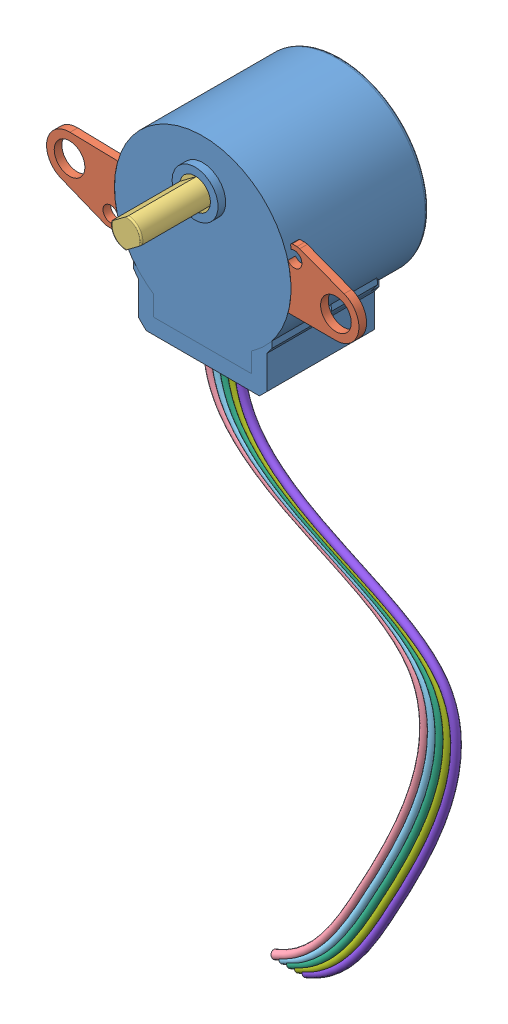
SolidWorks assembly Assem1.SLDASM, configuration Default (file format 9000). Lengths in mm.
Overall size (72.52 93.81 28.04).
10 component instances, 8 part files, 11 mates.
Components (placement in the parent):
- body-2: body.SLDPRT [Default] at (11.2318 21.8715 21.7612) size (23 25.66 19)
- hanger-2: hanger.SLDPRT [Default] at (-2.6622 24.7074 39.7612) x (-0.015684 -0.999877 0) z (0 0 -1) size (8.09 9.25 1)
- hanger-3: hanger.SLDPRT [Default] at (25.1817 19.3249 39.7612) x (-0.005099 0.999987 0) z (0 0 -1) size (8.09 9.25 1)
- shaft-2: shaft.SLDPRT [Default] at (11.2318 27.3715 39.7612) x (0.599727 -0.800205 0) z (0 0 1) size (4.01 4.01 10.04)
- Assem4^Assem1-1: Assem4^Assem1.sldasm [Default] at (61.8988 -37.2277 37.04) x (0.699865 0.714275 0) z (0 0 1) size (45.94 56.51 1.02) (virtual)
  - wire5-p-1: wire5-p.SLDPRT [Default] at origin size (43.12 53.63 1)
  - wire4-y-1: wire4-y.SLDPRT [Default] at (0.7023 -0.7168 -0.0037) size (43.12 53.63 1)
  - wire3-r-1: wire3-r.SLDPRT [Default] at (1.4095 -1.4385 0.0049) size (43.12 53.63 1)
  - wire2-b-1: wire2-b.SLDPRT [Default] at (2.1218 -2.1655 -0.0059) size (43.12 53.63 1)
  - wire1-1: wire1.SLDPRT [Default] at (2.8268 -2.885 0.0106) size (43.12 53.63 1)
Mates (geometry in assembly coordinates):
- Concentric7: concentric anti-aligned: cylinder of body-2 through (11.2318 21.8715 39.7612) axis (0 0 -1) radius 11.5; cylinder of hanger-2 through (11.2318 21.8715 38.7612) axis (0 0 1) radius 11.5
- Concentric8: concentric anti-aligned: cylinder of body-2 through (11.2318 21.8715 39.7612) axis (0 0 -1) radius 11.5; cylinder of hanger-3 through (11.2318 21.8715 38.7612) axis (0 0 1) radius 11.5
- Coincident3: coincident aligned: plane of body-2 through (11.2318 21.8715 39.7612) normal (0 0 1); plane of hanger-3 through (28.5967 21.96 39.7612) normal (0 0 1)
- Coincident4: coincident aligned: plane of body-2 through (11.2318 21.8715 39.7612) normal (0 0 1); plane of hanger-2 through (-6.1313 22.1438 39.7612) normal (0 0 1)
- Coincident7: coincident aligned: axis of body-2 through (11.2318 27.3715 40.7613) axis (0 0 -1); axis of shaft-2 through (11.2318 27.3715 49.5612) axis (0 0 -1)
- Coincident25: coincident anti-aligned: plane of body-2 through (2.8437 7.7125 25.7612) normal (0 -1 0); plane of Assem4^Assem1-1/wire5-p-1 through (9.7892 7.7125 37.04) normal (0 1 0)
- Coincident26: coincident anti-aligned: plane of body-2 through (2.8437 7.7125 25.7612) normal (0 -1 0); plane of Assem4^Assem1-1/wire4-y-1 through (10.7927 7.7125 37.0363) normal (0 1 0)
- Coincident27: coincident anti-aligned: plane of body-2 through (2.8437 7.7125 25.7612) normal (0 -1 0); plane of Assem4^Assem1-1/wire3-r-1 through (11.8031 7.7125 37.0449) normal (0 1 0)
- Coincident28: coincident anti-aligned: plane of body-2 through (2.8437 7.7125 25.7612) normal (0 -1 0); plane of Assem4^Assem1-1/wire2-b-1 through (12.8209 7.7125 37.0341) normal (0 1 0)
- Coincident29: coincident anti-aligned: plane of body-2 through (2.8437 7.7125 25.7612) normal (0 -1 0); plane of Assem4^Assem1-1/wire1-1 through (13.8282 7.7125 37.0506) normal (0 1 0)
- Coincident31: coincident anti-aligned: plane of body-2 through (11.2318 27.3715 39.7612) normal (0 0 1); plane of shaft-2 through (11.2318 27.3715 39.7612) normal (0 0 -1)
